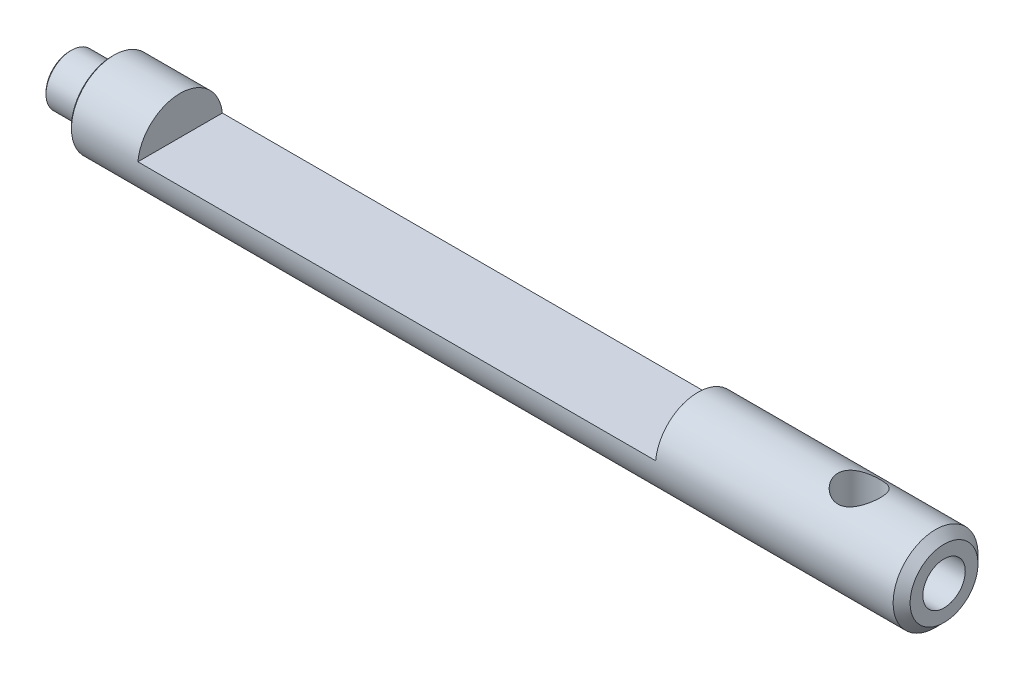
ISO-10303-21;
HEADER;
FILE_DESCRIPTION(('STEP AP214'),'2;1');
FILE_NAME('part.step','',(''),(''),'','','');
FILE_SCHEMA(('AUTOMOTIVE_DESIGN { 1 0 10303 214 1 1 1 1 }'));
ENDSEC;
DATA;
#1=APPLICATION_CONTEXT('core data for automotive mechanical design processes');
#2=APPLICATION_PROTOCOL_DEFINITION('international standard','automotive_design',2000,#1);
#3=PRODUCT_CONTEXT('',#1,'mechanical');
#4=PRODUCT('Part','Part','',(#3));
#5=PRODUCT_RELATED_PRODUCT_CATEGORY('part','',(#4));
#6=PRODUCT_DEFINITION_FORMATION('','',#4);
#7=PRODUCT_DEFINITION_CONTEXT('part definition',#1,'design');
#8=PRODUCT_DEFINITION('design','',#6,#7);
#9=PRODUCT_DEFINITION_SHAPE('','',#8);
#10=(LENGTH_UNIT() NAMED_UNIT(*) SI_UNIT(.MILLI.,.METRE.));
#11=(NAMED_UNIT(*) PLANE_ANGLE_UNIT() SI_UNIT($,.RADIAN.));
#12=(NAMED_UNIT(*) SI_UNIT($,.STERADIAN.) SOLID_ANGLE_UNIT());
#13=UNCERTAINTY_MEASURE_WITH_UNIT(LENGTH_MEASURE(1.E-05),#10,'distance_accuracy_value','');
#14=(GEOMETRIC_REPRESENTATION_CONTEXT(3) GLOBAL_UNCERTAINTY_ASSIGNED_CONTEXT((#13)) GLOBAL_UNIT_ASSIGNED_CONTEXT((#10,
#11,#12)) REPRESENTATION_CONTEXT('',''));
#15=CARTESIAN_POINT('',(0.,0.,0.));
#16=DIRECTION('',(0.,0.,1.));
#17=DIRECTION('',(1.,0.,0.));
#18=AXIS2_PLACEMENT_3D('',#15,#16,#17);
#19=CARTESIAN_POINT('',(-49.,2.5,0.));
#20=DIRECTION('',(1.,0.,0.));
#21=DIRECTION('',(0.,0.,-1.));
#22=AXIS2_PLACEMENT_3D('',#19,#20,#21);
#23=PLANE('',#22);
#24=CARTESIAN_POINT('',(-49.,0.,0.));
#25=DIRECTION('',(1.,0.,0.));
#26=DIRECTION('',(0.,0.,-1.));
#27=AXIS2_PLACEMENT_3D('',#24,#25,#26);
#28=CIRCLE('',#27,2.4);
#29=CARTESIAN_POINT('',(-49.,0.,-2.4));
#30=VERTEX_POINT('',#29);
#31=EDGE_CURVE('E434',#30,#30,#28,.F.);
#32=ORIENTED_EDGE('',*,*,#31,.T.);
#33=EDGE_LOOP('',(#32));
#34=FACE_BOUND('',#33,.T.);
#35=CARTESIAN_POINT('',(-49.,0.,0.));
#36=DIRECTION('',(-1.,0.,0.));
#37=DIRECTION('',(0.,0.,1.));
#38=AXIS2_PLACEMENT_3D('',#35,#36,#37);
#39=CIRCLE('',#38,1.5);
#40=CARTESIAN_POINT('',(-49.,0.,1.5));
#41=VERTEX_POINT('',#40);
#42=EDGE_CURVE('E412',#41,#41,#39,.T.);
#43=ORIENTED_EDGE('',*,*,#42,.F.);
#44=EDGE_LOOP('',(#43));
#45=FACE_BOUND('',#44,.T.);
#46=ADVANCED_FACE('F362',(#34,#45),#23,.F.);
#47=CARTESIAN_POINT('',(-76.1671834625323,0.,0.));
#48=DIRECTION('',(-1.,0.,0.));
#49=DIRECTION('',(0.,0.,1.));
#50=AXIS2_PLACEMENT_3D('',#47,#48,#49);
#51=CYLINDRICAL_SURFACE('',#50,1.5);
#52=CARTESIAN_POINT('',(-51.4,0.,0.));
#53=DIRECTION('',(1.,0.,0.));
#54=DIRECTION('',(0.,0.,-1.));
#55=AXIS2_PLACEMENT_3D('',#52,#53,#54);
#56=CIRCLE('',#55,1.5);
#57=CARTESIAN_POINT('',(-51.4,0.,-1.5));
#58=VERTEX_POINT('',#57);
#59=EDGE_CURVE('E431',#58,#58,#56,.T.);
#60=ORIENTED_EDGE('',*,*,#59,.T.);
#61=EDGE_LOOP('',(#60));
#62=FACE_BOUND('',#61,.T.);
#63=ORIENTED_EDGE('',*,*,#42,.T.);
#64=EDGE_LOOP('',(#63));
#65=FACE_BOUND('',#64,.T.);
#66=ADVANCED_FACE('F485',(#62,#65),#51,.T.);
#67=CARTESIAN_POINT('',(-51.5,1.5,0.));
#68=DIRECTION('',(1.,0.,0.));
#69=DIRECTION('',(0.,0.,-1.));
#70=AXIS2_PLACEMENT_3D('',#67,#68,#69);
#71=PLANE('',#70);
#72=CARTESIAN_POINT('',(-51.5,0.,0.));
#73=DIRECTION('',(1.,0.,0.));
#74=DIRECTION('',(0.,0.,-1.));
#75=AXIS2_PLACEMENT_3D('',#72,#73,#74);
#76=CIRCLE('',#75,1.4);
#77=CARTESIAN_POINT('',(-51.5,0.,-1.4));
#78=VERTEX_POINT('',#77);
#79=EDGE_CURVE('E428',#78,#78,#76,.F.);
#80=ORIENTED_EDGE('',*,*,#79,.T.);
#81=EDGE_LOOP('',(#80));
#82=FACE_BOUND('',#81,.T.);
#83=ADVANCED_FACE('F490',(#82),#71,.F.);
#84=CARTESIAN_POINT('',(0.,2.5,0.));
#85=DIRECTION('',(-1.,0.,0.));
#86=DIRECTION('',(0.,0.,1.));
#87=AXIS2_PLACEMENT_3D('',#84,#85,#86);
#88=PLANE('',#87);
#89=CARTESIAN_POINT('',(0.,0.,0.));
#90=DIRECTION('',(1.,0.,0.));
#91=DIRECTION('',(0.,0.,-1.));
#92=AXIS2_PLACEMENT_3D('',#89,#90,#91);
#93=CIRCLE('',#92,1.25);
#94=CARTESIAN_POINT('',(0.,0.,-1.25));
#95=VERTEX_POINT('',#94);
#96=EDGE_CURVE('E405',#95,#95,#93,.T.);
#97=ORIENTED_EDGE('',*,*,#96,.F.);
#98=EDGE_LOOP('',(#97));
#99=FACE_BOUND('',#98,.T.);
#100=CARTESIAN_POINT('',(0.,0.,0.));
#101=DIRECTION('',(-1.,0.,0.));
#102=DIRECTION('',(0.,0.,1.));
#103=AXIS2_PLACEMENT_3D('',#100,#101,#102);
#104=CIRCLE('',#103,2.);
#105=CARTESIAN_POINT('',(0.,0.,2.));
#106=VERTEX_POINT('',#105);
#107=EDGE_CURVE('E443',#106,#106,#104,.F.);
#108=ORIENTED_EDGE('',*,*,#107,.T.);
#109=EDGE_LOOP('',(#108));
#110=FACE_BOUND('',#109,.T.);
#111=ADVANCED_FACE('F481',(#99,#110),#88,.F.);
#112=CARTESIAN_POINT('',(-76.1671834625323,0.,0.));
#113=DIRECTION('',(-1.,0.,0.));
#114=DIRECTION('',(0.,0.,1.));
#115=AXIS2_PLACEMENT_3D('',#112,#113,#114);
#116=CYLINDRICAL_SURFACE('',#115,2.5);
#117=CARTESIAN_POINT('',(-5.,-2.1650635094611,1.25));
#118=CARTESIAN_POINT('',(-4.93486523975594,-2.16506918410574,1.24999545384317));
#119=CARTESIAN_POINT('',(-4.86964823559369,-2.16804751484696,1.24487496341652));
#120=CARTESIAN_POINT('',(-4.74121591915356,-2.17952958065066,1.22465401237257));
#121=CARTESIAN_POINT('',(-4.67800510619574,-2.18804492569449,1.20953258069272));
#122=CARTESIAN_POINT('',(-4.55568541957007,-2.20936683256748,1.17012493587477));
#123=CARTESIAN_POINT('',(-4.49655668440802,-2.22215054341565,1.14588744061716));
#124=CARTESIAN_POINT('',(-4.3832197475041,-2.25053331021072,1.08908440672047));
#125=CARTESIAN_POINT('',(-4.32901181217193,-2.26613251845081,1.05651841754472));
#126=CARTESIAN_POINT('',(-4.22211783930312,-2.29996086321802,0.980833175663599));
#127=CARTESIAN_POINT('',(-4.16992608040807,-2.31830079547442,0.937065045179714));
#128=CARTESIAN_POINT('',(-4.07323951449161,-2.35464978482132,0.841567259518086));
#129=CARTESIAN_POINT('',(-4.0287485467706,-2.37265867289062,0.789833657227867));
#130=CARTESIAN_POINT('',(-3.94579106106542,-2.40776846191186,0.675611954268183));
#131=CARTESIAN_POINT('',(-3.90793279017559,-2.42472633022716,0.612633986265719));
#132=CARTESIAN_POINT('',(-3.8435739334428,-2.45438445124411,0.480196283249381));
#133=CARTESIAN_POINT('',(-3.81706617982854,-2.46708738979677,0.410740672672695));
#134=CARTESIAN_POINT('',(-3.77811917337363,-2.48600576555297,0.272556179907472));
#135=CARTESIAN_POINT('',(-3.76481309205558,-2.49261850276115,0.204127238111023));
#136=CARTESIAN_POINT('',(-3.7497923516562,-2.50009479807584,0.0657132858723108));
#137=CARTESIAN_POINT('',(-3.74807067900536,-2.50096183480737,-0.00427075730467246));
#138=CARTESIAN_POINT('',(-3.75593334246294,-2.49703727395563,-0.137290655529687));
#139=CARTESIAN_POINT('',(-3.76454751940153,-2.492731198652,-0.200401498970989));
#140=CARTESIAN_POINT('',(-3.79110105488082,-2.47967806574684,-0.324142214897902));
#141=CARTESIAN_POINT('',(-3.80904111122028,-2.47093067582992,-0.384771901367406));
#142=CARTESIAN_POINT('',(-3.85385320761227,-2.44964479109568,-0.502886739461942));
#143=CARTESIAN_POINT('',(-3.88084539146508,-2.43705551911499,-0.560316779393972));
#144=CARTESIAN_POINT('',(-3.94282927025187,-2.40922057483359,-0.66997100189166));
#145=CARTESIAN_POINT('',(-3.97782382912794,-2.39397395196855,-0.722193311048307));
#146=CARTESIAN_POINT('',(-4.05861918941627,-2.36055492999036,-0.825217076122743));
#147=CARTESIAN_POINT('',(-4.10512878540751,-2.34224219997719,-0.8754175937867));
#148=CARTESIAN_POINT('',(-4.20573715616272,-2.30567925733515,-0.967630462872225));
#149=CARTESIAN_POINT('',(-4.25984171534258,-2.28742910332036,-1.00963651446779));
#150=CARTESIAN_POINT('',(-4.37831024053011,-2.25180195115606,-1.08688166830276));
#151=CARTESIAN_POINT('',(-4.44310752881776,-2.23455399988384,-1.12152164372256));
#152=CARTESIAN_POINT('',(-4.57867208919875,-2.2046931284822,-1.17914889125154));
#153=CARTESIAN_POINT('',(-4.64943304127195,-2.19207537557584,-1.20214832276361));
#154=CARTESIAN_POINT('',(-4.78901813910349,-2.17430794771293,-1.2339752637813));
#155=CARTESIAN_POINT('',(-4.85755139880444,-2.1686456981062,-1.24378140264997));
#156=CARTESIAN_POINT('',(-4.99550167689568,-2.16397399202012,-1.25189618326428));
#157=CARTESIAN_POINT('',(-5.06491803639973,-2.1649598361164,-1.25021294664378));
#158=CARTESIAN_POINT('',(-5.19456739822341,-2.17292920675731,-1.23629505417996));
#159=CARTESIAN_POINT('',(-5.25497431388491,-2.17924484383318,-1.22523477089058));
#160=CARTESIAN_POINT('',(-5.3729597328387,-2.19617526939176,-1.19462035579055));
#161=CARTESIAN_POINT('',(-5.43053731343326,-2.20679145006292,-1.17506347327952));
#162=CARTESIAN_POINT('',(-5.54426416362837,-2.23170277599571,-1.12705948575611));
#163=CARTESIAN_POINT('',(-5.60022377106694,-2.24614554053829,-1.0982425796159));
#164=CARTESIAN_POINT('',(-5.70683658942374,-2.27695149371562,-1.03285883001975));
#165=CARTESIAN_POINT('',(-5.75748705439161,-2.29331566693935,-0.996288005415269));
#166=CARTESIAN_POINT('',(-5.85872345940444,-2.3285999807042,-0.911046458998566));
#167=CARTESIAN_POINT('',(-5.90849643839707,-2.34758228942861,-0.861431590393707));
#168=CARTESIAN_POINT('',(-5.99926529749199,-2.38417793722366,-0.75425561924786));
#169=CARTESIAN_POINT('',(-6.04025821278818,-2.40179081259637,-0.696691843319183));
#170=CARTESIAN_POINT('',(-6.11321715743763,-2.43426702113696,-0.573169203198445));
#171=CARTESIAN_POINT('',(-6.14491639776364,-2.44904552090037,-0.50702887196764));
#172=CARTESIAN_POINT('',(-6.19642237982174,-2.47354193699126,-0.369402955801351));
#173=CARTESIAN_POINT('',(-6.21623956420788,-2.48326429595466,-0.297922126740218));
#174=CARTESIAN_POINT('',(-6.24171070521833,-2.49584385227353,-0.15872460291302));
#175=CARTESIAN_POINT('',(-6.24849734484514,-2.49924909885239,-0.0912643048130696));
#176=CARTESIAN_POINT('',(-6.251054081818,-2.50052662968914,0.0439074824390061));
#177=CARTESIAN_POINT('',(-6.24682803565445,-2.49840085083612,0.11161887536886));
#178=CARTESIAN_POINT('',(-6.22822949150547,-2.48917461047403,0.240672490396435));
#179=CARTESIAN_POINT('',(-6.21454393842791,-2.48241118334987,0.302140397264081));
#180=CARTESIAN_POINT('',(-6.17834125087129,-2.46490117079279,0.421807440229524));
#181=CARTESIAN_POINT('',(-6.15582284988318,-2.45415401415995,0.480006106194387));
#182=CARTESIAN_POINT('',(-6.10159118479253,-2.4290741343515,0.594279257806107));
#183=CARTESIAN_POINT('',(-6.0695258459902,-2.41460771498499,0.650156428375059));
#184=CARTESIAN_POINT('',(-5.99755258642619,-2.38360166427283,0.755968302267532));
#185=CARTESIAN_POINT('',(-5.95764106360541,-2.36706108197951,0.805900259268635));
#186=CARTESIAN_POINT('',(-5.86650357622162,-2.33160762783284,0.903642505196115));
#187=CARTESIAN_POINT('',(-5.81454689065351,-2.31262248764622,0.95074710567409));
#188=CARTESIAN_POINT('',(-5.70318659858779,-2.27578845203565,1.03582910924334));
#189=CARTESIAN_POINT('',(-5.64377647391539,-2.25794057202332,1.07379843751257));
#190=CARTESIAN_POINT('',(-5.5167041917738,-2.22499506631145,1.14053884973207));
#191=CARTESIAN_POINT('',(-5.44884058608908,-2.21000217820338,1.16898133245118));
#192=CARTESIAN_POINT('',(-5.30833449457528,-2.18582695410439,1.21359838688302));
#193=CARTESIAN_POINT('',(-5.23570888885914,-2.17662520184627,1.22981398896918));
#194=CARTESIAN_POINT('',(-5.135243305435,-2.16911590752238,1.24295875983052));
#195=CARTESIAN_POINT('',(-5.10829013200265,-2.1676016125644,1.24559513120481));
#196=CARTESIAN_POINT('',(-5.0542293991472,-2.16557419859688,1.24911675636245));
#197=CARTESIAN_POINT('',(-5.02712182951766,-2.16506114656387,1.25000189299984));
#198=CARTESIAN_POINT('',(-5.,-2.1650635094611,1.25));
#199=B_SPLINE_CURVE_WITH_KNOTS('',3,(#117,#118,#119,#120,#121,#122,#123,#124,#125,#126,#127,
#128,#129,#130,#131,#132,#133,#134,#135,#136,#137,#138,#139,#140,#141,#142,#143,#144,#145,#146,
#147,#148,#149,#150,#151,#152,#153,#154,#155,#156,#157,#158,#159,#160,#161,#162,#163,#164,#165,
#166,#167,#168,#169,#170,#171,#172,#173,#174,#175,#176,#177,#178,#179,#180,#181,#182,#183,#184,
#185,#186,#187,#188,#189,#190,#191,#192,#193,#194,#195,#196,#197,#198),.UNSPECIFIED.,.T.,.F.,(4,
2,2,2,2,2,2,2,2,2,2,2,2,2,2,2,2,2,2,2,2,2,2,2,2,2,2,2,2,2,2,2,2,2,2,2,2,2,2,2,4),(0.,
0.195290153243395,0.390991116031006,0.585660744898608,0.780340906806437,0.991077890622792,
1.20191963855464,1.42697365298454,1.65188533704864,1.86079356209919,2.0695752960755,
2.26020121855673,2.45084140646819,2.64411918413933,2.8374662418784,3.04908989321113,
3.26087560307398,3.48611052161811,3.71110967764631,3.91827863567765,4.12530116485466,
4.30967729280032,4.49411315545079,4.6870912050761,4.88016857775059,5.09758429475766,
5.31507331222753,5.53830226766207,5.76133474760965,5.96390337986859,6.16640108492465,
6.35555531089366,6.54473666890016,6.7420093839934,6.93937287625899,7.15637802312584,
7.37357428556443,7.59763436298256,7.8209391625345,7.90225168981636,7.98356965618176),.UNSPECIFIED.);
#200=CARTESIAN_POINT('',(-5.,-2.1650635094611,1.25));
#201=VERTEX_POINT('',#200);
#202=EDGE_CURVE('E11',#201,#201,#199,.T.);
#203=ORIENTED_EDGE('',*,*,#202,.T.);
#204=EDGE_LOOP('',(#203));
#205=FACE_BOUND('',#204,.T.);
#206=CARTESIAN_POINT('',(-5.,2.1650635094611,1.25));
#207=CARTESIAN_POINT('',(-5.06513476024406,2.16506918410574,1.24999545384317));
#208=CARTESIAN_POINT('',(-5.13035176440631,2.16804751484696,1.24487496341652));
#209=CARTESIAN_POINT('',(-5.25878408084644,2.17952958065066,1.22465401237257));
#210=CARTESIAN_POINT('',(-5.32199489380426,2.18804492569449,1.20953258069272));
#211=CARTESIAN_POINT('',(-5.44431458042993,2.20936683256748,1.17012493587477));
#212=CARTESIAN_POINT('',(-5.50344331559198,2.22215054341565,1.14588744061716));
#213=CARTESIAN_POINT('',(-5.6167802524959,2.25053331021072,1.08908440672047));
#214=CARTESIAN_POINT('',(-5.67098818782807,2.26613251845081,1.05651841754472));
#215=CARTESIAN_POINT('',(-5.77788216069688,2.29996086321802,0.980833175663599));
#216=CARTESIAN_POINT('',(-5.83007391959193,2.31830079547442,0.937065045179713));
#217=CARTESIAN_POINT('',(-5.92676048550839,2.35464978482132,0.841567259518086));
#218=CARTESIAN_POINT('',(-5.9712514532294,2.37265867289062,0.789833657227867));
#219=CARTESIAN_POINT('',(-6.05420893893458,2.40776846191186,0.675611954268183));
#220=CARTESIAN_POINT('',(-6.09206720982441,2.42472633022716,0.612633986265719));
#221=CARTESIAN_POINT('',(-6.1564260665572,2.45438445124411,0.480196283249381));
#222=CARTESIAN_POINT('',(-6.18293382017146,2.46708738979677,0.410740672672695));
#223=CARTESIAN_POINT('',(-6.22188082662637,2.48600576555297,0.272556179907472));
#224=CARTESIAN_POINT('',(-6.23518690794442,2.49261850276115,0.204127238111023));
#225=CARTESIAN_POINT('',(-6.2502076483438,2.50009479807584,0.0657132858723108));
#226=CARTESIAN_POINT('',(-6.25192932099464,2.50096183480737,-0.0042707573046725));
#227=CARTESIAN_POINT('',(-6.24406665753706,2.49703727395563,-0.137290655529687));
#228=CARTESIAN_POINT('',(-6.23545248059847,2.492731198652,-0.200401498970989));
#229=CARTESIAN_POINT('',(-6.20889894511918,2.47967806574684,-0.324142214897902));
#230=CARTESIAN_POINT('',(-6.19095888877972,2.47093067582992,-0.384771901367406));
#231=CARTESIAN_POINT('',(-6.14614679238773,2.44964479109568,-0.502886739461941));
#232=CARTESIAN_POINT('',(-6.11915460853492,2.43705551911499,-0.560316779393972));
#233=CARTESIAN_POINT('',(-6.05717072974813,2.40922057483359,-0.66997100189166));
#234=CARTESIAN_POINT('',(-6.02217617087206,2.39397395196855,-0.722193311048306));
#235=CARTESIAN_POINT('',(-5.94138081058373,2.36055492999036,-0.825217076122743));
#236=CARTESIAN_POINT('',(-5.89487121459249,2.34224219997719,-0.8754175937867));
#237=CARTESIAN_POINT('',(-5.79426284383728,2.30567925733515,-0.967630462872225));
#238=CARTESIAN_POINT('',(-5.74015828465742,2.28742910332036,-1.00963651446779));
#239=CARTESIAN_POINT('',(-5.62168975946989,2.25180195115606,-1.08688166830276));
#240=CARTESIAN_POINT('',(-5.55689247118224,2.23455399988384,-1.12152164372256));
#241=CARTESIAN_POINT('',(-5.42132791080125,2.2046931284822,-1.17914889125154));
#242=CARTESIAN_POINT('',(-5.35056695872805,2.19207537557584,-1.20214832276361));
#243=CARTESIAN_POINT('',(-5.21098186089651,2.17430794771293,-1.2339752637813));
#244=CARTESIAN_POINT('',(-5.14244860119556,2.16864569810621,-1.24378140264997));
#245=CARTESIAN_POINT('',(-5.00449832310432,2.16397399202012,-1.25189618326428));
#246=CARTESIAN_POINT('',(-4.93508196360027,2.16495983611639,-1.25021294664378));
#247=CARTESIAN_POINT('',(-4.80543260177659,2.17292920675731,-1.23629505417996));
#248=CARTESIAN_POINT('',(-4.74502568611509,2.17924484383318,-1.22523477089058));
#249=CARTESIAN_POINT('',(-4.6270402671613,2.19617526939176,-1.19462035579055));
#250=CARTESIAN_POINT('',(-4.56946268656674,2.20679145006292,-1.17506347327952));
#251=CARTESIAN_POINT('',(-4.45573583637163,2.23170277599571,-1.12705948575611));
#252=CARTESIAN_POINT('',(-4.39977622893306,2.24614554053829,-1.0982425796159));
#253=CARTESIAN_POINT('',(-4.29316341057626,2.27695149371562,-1.03285883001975));
#254=CARTESIAN_POINT('',(-4.2425129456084,2.29331566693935,-0.99628800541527));
#255=CARTESIAN_POINT('',(-4.14127654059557,2.3285999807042,-0.911046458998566));
#256=CARTESIAN_POINT('',(-4.09150356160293,2.34758228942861,-0.861431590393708));
#257=CARTESIAN_POINT('',(-4.00073470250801,2.38417793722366,-0.75425561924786));
#258=CARTESIAN_POINT('',(-3.95974178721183,2.40179081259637,-0.696691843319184));
#259=CARTESIAN_POINT('',(-3.88678284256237,2.43426702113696,-0.573169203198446));
#260=CARTESIAN_POINT('',(-3.85508360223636,2.44904552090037,-0.507028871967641));
#261=CARTESIAN_POINT('',(-3.80357762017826,2.47354193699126,-0.369402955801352));
#262=CARTESIAN_POINT('',(-3.78376043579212,2.48326429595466,-0.29792212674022));
#263=CARTESIAN_POINT('',(-3.75828929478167,2.49584385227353,-0.158724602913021));
#264=CARTESIAN_POINT('',(-3.75150265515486,2.49924909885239,-0.0912643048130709));
#265=CARTESIAN_POINT('',(-3.748945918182,2.50052662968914,0.0439074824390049));
#266=CARTESIAN_POINT('',(-3.75317196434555,2.49840085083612,0.111618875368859));
#267=CARTESIAN_POINT('',(-3.77177050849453,2.48917461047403,0.240672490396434));
#268=CARTESIAN_POINT('',(-3.78545606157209,2.48241118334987,0.30214039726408));
#269=CARTESIAN_POINT('',(-3.82165874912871,2.46490117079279,0.421807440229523));
#270=CARTESIAN_POINT('',(-3.84417715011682,2.45415401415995,0.480006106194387));
#271=CARTESIAN_POINT('',(-3.89840881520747,2.4290741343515,0.594279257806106));
#272=CARTESIAN_POINT('',(-3.9304741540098,2.41460771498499,0.650156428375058));
#273=CARTESIAN_POINT('',(-4.00244741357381,2.38360166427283,0.755968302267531));
#274=CARTESIAN_POINT('',(-4.04235893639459,2.36706108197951,0.805900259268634));
#275=CARTESIAN_POINT('',(-4.13349642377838,2.33160762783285,0.903642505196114));
#276=CARTESIAN_POINT('',(-4.18545310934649,2.31262248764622,0.95074710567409));
#277=CARTESIAN_POINT('',(-4.29681340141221,2.27578845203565,1.03582910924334));
#278=CARTESIAN_POINT('',(-4.35622352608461,2.25794057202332,1.07379843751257));
#279=CARTESIAN_POINT('',(-4.48329580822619,2.22499506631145,1.14053884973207));
#280=CARTESIAN_POINT('',(-4.55115941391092,2.21000217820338,1.16898133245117));
#281=CARTESIAN_POINT('',(-4.69166550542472,2.18582695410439,1.21359838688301));
#282=CARTESIAN_POINT('',(-4.76429111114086,2.17662520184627,1.22981398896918));
#283=CARTESIAN_POINT('',(-4.864756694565,2.16911590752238,1.24295875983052));
#284=CARTESIAN_POINT('',(-4.89170986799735,2.1676016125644,1.24559513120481));
#285=CARTESIAN_POINT('',(-4.9457706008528,2.16557419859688,1.24911675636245));
#286=CARTESIAN_POINT('',(-4.97287817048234,2.16506114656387,1.25000189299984));
#287=CARTESIAN_POINT('',(-5.,2.1650635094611,1.25));
#288=B_SPLINE_CURVE_WITH_KNOTS('',3,(#206,#207,#208,#209,#210,#211,#212,#213,#214,#215,#216,
#217,#218,#219,#220,#221,#222,#223,#224,#225,#226,#227,#228,#229,#230,#231,#232,#233,#234,#235,
#236,#237,#238,#239,#240,#241,#242,#243,#244,#245,#246,#247,#248,#249,#250,#251,#252,#253,#254,
#255,#256,#257,#258,#259,#260,#261,#262,#263,#264,#265,#266,#267,#268,#269,#270,#271,#272,#273,
#274,#275,#276,#277,#278,#279,#280,#281,#282,#283,#284,#285,#286,#287),.UNSPECIFIED.,.T.,.F.,(4,
2,2,2,2,2,2,2,2,2,2,2,2,2,2,2,2,2,2,2,2,2,2,2,2,2,2,2,2,2,2,2,2,2,2,2,2,2,2,2,4),(0.,
0.195290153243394,0.390991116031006,0.585660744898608,0.780340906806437,0.991077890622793,
1.20191963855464,1.42697365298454,1.65188533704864,1.86079356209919,2.0695752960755,
2.26020121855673,2.45084140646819,2.64411918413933,2.8374662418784,3.04908989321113,
3.26087560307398,3.4861105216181,3.71110967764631,3.91827863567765,4.12530116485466,
4.30967729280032,4.49411315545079,4.6870912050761,4.88016857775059,5.09758429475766,
5.31507331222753,5.53830226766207,5.76133474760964,5.96390337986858,6.16640108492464,
6.35555531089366,6.54473666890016,6.7420093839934,6.93937287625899,7.15637802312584,
7.37357428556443,7.59763436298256,7.8209391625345,7.90225168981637,7.98356965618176),.UNSPECIFIED.);
#289=CARTESIAN_POINT('',(-5.,2.1650635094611,1.25));
#290=VERTEX_POINT('',#289);
#291=EDGE_CURVE('E373',#290,#290,#288,.T.);
#292=ORIENTED_EDGE('',*,*,#291,.T.);
#293=EDGE_LOOP('',(#292));
#294=FACE_BOUND('',#293,.T.);
#295=CARTESIAN_POINT('',(-0.5,0.,0.));
#296=DIRECTION('',(-1.,0.,0.));
#297=DIRECTION('',(0.,0.,1.));
#298=AXIS2_PLACEMENT_3D('',#295,#296,#297);
#299=CIRCLE('',#298,2.5);
#300=CARTESIAN_POINT('',(-0.5,0.,2.5));
#301=VERTEX_POINT('',#300);
#302=EDGE_CURVE('E440',#301,#301,#299,.T.);
#303=ORIENTED_EDGE('',*,*,#302,.T.);
#304=EDGE_LOOP('',(#303));
#305=FACE_BOUND('',#304,.T.);
#306=CARTESIAN_POINT('',(-48.9,0.,0.));
#307=DIRECTION('',(1.,0.,0.));
#308=DIRECTION('',(0.,0.,-1.));
#309=AXIS2_PLACEMENT_3D('',#306,#307,#308);
#310=CIRCLE('',#309,2.5);
#311=CARTESIAN_POINT('',(-48.9,0.,-2.5));
#312=VERTEX_POINT('',#311);
#313=EDGE_CURVE('E437',#312,#312,#310,.T.);
#314=ORIENTED_EDGE('',*,*,#313,.T.);
#315=EDGE_LOOP('',(#314));
#316=FACE_BOUND('',#315,.T.);
#317=CARTESIAN_POINT('',(-14.5,0.,0.));
#318=DIRECTION('',(1.,0.,0.));
#319=DIRECTION('',(0.,0.,-1.));
#320=AXIS2_PLACEMENT_3D('',#317,#318,#319);
#321=CIRCLE('',#320,2.5);
#322=CARTESIAN_POINT('',(-14.5,0.249999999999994,-2.48746859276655));
#323=VERTEX_POINT('',#322);
#324=CARTESIAN_POINT('',(-14.5,0.249999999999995,2.48746859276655));
#325=VERTEX_POINT('',#324);
#326=EDGE_CURVE('E420',#323,#325,#321,.T.);
#327=ORIENTED_EDGE('',*,*,#326,.T.);
#328=DIRECTION('',(-1.,0.,0.));
#329=VECTOR('',#328,1.);
#330=CARTESIAN_POINT('',(-76.1671834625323,0.249999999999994,2.48746859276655));
#331=LINE('',#330,#329);
#332=CARTESIAN_POINT('',(-45.,0.249999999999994,2.48746859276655));
#333=VERTEX_POINT('',#332);
#334=EDGE_CURVE('E425',#325,#333,#331,.T.);
#335=ORIENTED_EDGE('',*,*,#334,.T.);
#336=CARTESIAN_POINT('',(-45.,0.,0.));
#337=DIRECTION('',(-1.,0.,0.));
#338=DIRECTION('',(0.,0.,1.));
#339=AXIS2_PLACEMENT_3D('',#336,#337,#338);
#340=CIRCLE('',#339,2.5);
#341=CARTESIAN_POINT('',(-45.,0.249999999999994,-2.48746859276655));
#342=VERTEX_POINT('',#341);
#343=EDGE_CURVE('E422',#333,#342,#340,.T.);
#344=ORIENTED_EDGE('',*,*,#343,.T.);
#345=DIRECTION('',(-1.,0.,0.));
#346=VECTOR('',#345,1.);
#347=CARTESIAN_POINT('',(-76.1671834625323,0.249999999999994,-2.48746859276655));
#348=LINE('',#347,#346);
#349=EDGE_CURVE('E417',#342,#323,#348,.F.);
#350=ORIENTED_EDGE('',*,*,#349,.T.);
#351=EDGE_LOOP('',(#327,#335,#344,#350));
#352=FACE_BOUND('',#351,.T.);
#353=ADVANCED_FACE('F448',(#205,#294,#305,#316,#352),#116,.T.);
#354=CARTESIAN_POINT('',(-45.,2.5,-8.5));
#355=DIRECTION('',(-1.,0.,0.));
#356=DIRECTION('',(0.,0.,1.));
#357=AXIS2_PLACEMENT_3D('',#354,#355,#356);
#358=PLANE('',#357);
#359=DIRECTION('',(0.,0.,1.));
#360=VECTOR('',#359,1.);
#361=CARTESIAN_POINT('',(-45.,0.249999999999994,-8.5));
#362=LINE('',#361,#360);
#363=EDGE_CURVE('E408',#342,#333,#362,.T.);
#364=ORIENTED_EDGE('',*,*,#363,.F.);
#365=ORIENTED_EDGE('',*,*,#343,.F.);
#366=EDGE_LOOP('',(#364,#365));
#367=FACE_BOUND('',#366,.T.);
#368=ADVANCED_FACE('F473',(#367),#358,.F.);
#369=CARTESIAN_POINT('',(-14.5,2.5,-8.5));
#370=DIRECTION('',(1.,0.,0.));
#371=DIRECTION('',(0.,0.,-1.));
#372=AXIS2_PLACEMENT_3D('',#369,#370,#371);
#373=PLANE('',#372);
#374=DIRECTION('',(0.,0.,1.));
#375=VECTOR('',#374,1.);
#376=CARTESIAN_POINT('',(-14.5,0.249999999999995,-8.5));
#377=LINE('',#376,#375);
#378=EDGE_CURVE('E387',#323,#325,#377,.T.);
#379=ORIENTED_EDGE('',*,*,#378,.T.);
#380=ORIENTED_EDGE('',*,*,#326,.F.);
#381=EDGE_LOOP('',(#379,#380));
#382=FACE_BOUND('',#381,.T.);
#383=ADVANCED_FACE('F470',(#382),#373,.F.);
#384=CARTESIAN_POINT('',(-45.,0.249999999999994,-8.5));
#385=DIRECTION('',(0.,-1.,0.));
#386=DIRECTION('',(1.,0.,0.));
#387=AXIS2_PLACEMENT_3D('',#384,#385,#386);
#388=PLANE('',#387);
#389=ORIENTED_EDGE('',*,*,#378,.F.);
#390=ORIENTED_EDGE('',*,*,#349,.F.);
#391=ORIENTED_EDGE('',*,*,#363,.T.);
#392=ORIENTED_EDGE('',*,*,#334,.F.);
#393=EDGE_LOOP('',(#389,#390,#391,#392));
#394=FACE_BOUND('',#393,.T.);
#395=ADVANCED_FACE('F468',(#394),#388,.F.);
#396=CARTESIAN_POINT('',(-51.5,0.,0.));
#397=DIRECTION('',(1.,0.,0.));
#398=DIRECTION('',(0.,0.,-1.));
#399=AXIS2_PLACEMENT_3D('',#396,#397,#398);
#400=CONICAL_SURFACE('',#399,1.4,0.785398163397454);
#401=ORIENTED_EDGE('',*,*,#59,.F.);
#402=EDGE_LOOP('',(#401));
#403=FACE_BOUND('',#402,.T.);
#404=ORIENTED_EDGE('',*,*,#79,.F.);
#405=EDGE_LOOP('',(#404));
#406=FACE_BOUND('',#405,.T.);
#407=ADVANCED_FACE('F464',(#403,#406),#400,.T.);
#408=CARTESIAN_POINT('',(-49.,0.,0.));
#409=DIRECTION('',(1.,0.,0.));
#410=DIRECTION('',(0.,0.,-1.));
#411=AXIS2_PLACEMENT_3D('',#408,#409,#410);
#412=CONICAL_SURFACE('',#411,2.4,0.785398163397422);
#413=ORIENTED_EDGE('',*,*,#313,.F.);
#414=EDGE_LOOP('',(#413));
#415=FACE_BOUND('',#414,.T.);
#416=ORIENTED_EDGE('',*,*,#31,.F.);
#417=EDGE_LOOP('',(#416));
#418=FACE_BOUND('',#417,.T.);
#419=ADVANCED_FACE('F460',(#415,#418),#412,.T.);
#420=CARTESIAN_POINT('',(-0.5,0.,0.));
#421=DIRECTION('',(-1.,0.,0.));
#422=DIRECTION('',(0.,0.,1.));
#423=AXIS2_PLACEMENT_3D('',#420,#421,#422);
#424=CONICAL_SURFACE('',#423,2.5,0.78539816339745);
#425=ORIENTED_EDGE('',*,*,#107,.F.);
#426=EDGE_LOOP('',(#425));
#427=FACE_BOUND('',#426,.T.);
#428=ORIENTED_EDGE('',*,*,#302,.F.);
#429=EDGE_LOOP('',(#428));
#430=FACE_BOUND('',#429,.T.);
#431=ADVANCED_FACE('F456',(#427,#430),#424,.T.);
#432=CARTESIAN_POINT('',(-5.,-2.5,0.));
#433=DIRECTION('',(0.,1.,0.));
#434=DIRECTION('',(0.,0.,1.));
#435=AXIS2_PLACEMENT_3D('',#432,#433,#434);
#436=CYLINDRICAL_SURFACE('',#435,1.25);
#437=CARTESIAN_POINT('',(-5.,0.,0.));
#438=DIRECTION('',(0.707106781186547,-0.707106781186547,0.));
#439=DIRECTION('',(0.707106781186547,0.707106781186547,0.));
#440=AXIS2_PLACEMENT_3D('',#437,#438,#439);
#441=ELLIPSE('',#440,1.76776695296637,1.25);
#442=CARTESIAN_POINT('',(-5.,0.,1.25));
#443=VERTEX_POINT('',#442);
#444=CARTESIAN_POINT('',(-5.,0.,-1.25));
#445=VERTEX_POINT('',#444);
#446=EDGE_CURVE('E398',#443,#445,#441,.F.);
#447=ORIENTED_EDGE('',*,*,#446,.F.);
#448=CARTESIAN_POINT('',(-5.,0.,0.));
#449=DIRECTION('',(0.707106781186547,0.707106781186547,0.));
#450=DIRECTION('',(0.707106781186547,-0.707106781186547,0.));
#451=AXIS2_PLACEMENT_3D('',#448,#449,#450);
#452=ELLIPSE('',#451,1.76776695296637,1.25);
#453=EDGE_CURVE('E379',#445,#443,#452,.F.);
#454=ORIENTED_EDGE('',*,*,#453,.F.);
#455=EDGE_LOOP('',(#447,#454));
#456=FACE_BOUND('',#455,.T.);
#457=ORIENTED_EDGE('',*,*,#291,.F.);
#458=EDGE_LOOP('',(#457));
#459=FACE_BOUND('',#458,.T.);
#460=ORIENTED_EDGE('',*,*,#202,.F.);
#461=EDGE_LOOP('',(#460));
#462=FACE_BOUND('',#461,.T.);
#463=ADVANCED_FACE('F403',(#456,#459,#462),#436,.F.);
#464=CARTESIAN_POINT('',(-51.501,0.,0.));
#465=DIRECTION('',(1.,0.,0.));
#466=DIRECTION('',(0.,0.,-1.));
#467=AXIS2_PLACEMENT_3D('',#464,#465,#466);
#468=CYLINDRICAL_SURFACE('',#467,1.25);
#469=ORIENTED_EDGE('',*,*,#453,.T.);
#470=ORIENTED_EDGE('',*,*,#446,.T.);
#471=EDGE_LOOP('',(#469,#470));
#472=FACE_BOUND('',#471,.T.);
#473=ORIENTED_EDGE('',*,*,#96,.T.);
#474=EDGE_LOOP('',(#473));
#475=FACE_BOUND('',#474,.T.);
#476=ADVANCED_FACE('F399',(#472,#475),#468,.F.);
#477=CLOSED_SHELL('',(#46,#66,#83,#111,#353,#368,#383,#395,#407,#419,#431,#463,#476));
#478=MANIFOLD_SOLID_BREP('B2',#477);
#479=ADVANCED_BREP_SHAPE_REPRESENTATION('',(#18,#478),#14);
#480=SHAPE_DEFINITION_REPRESENTATION(#9,#479);
ENDSEC;
END-ISO-10303-21;
